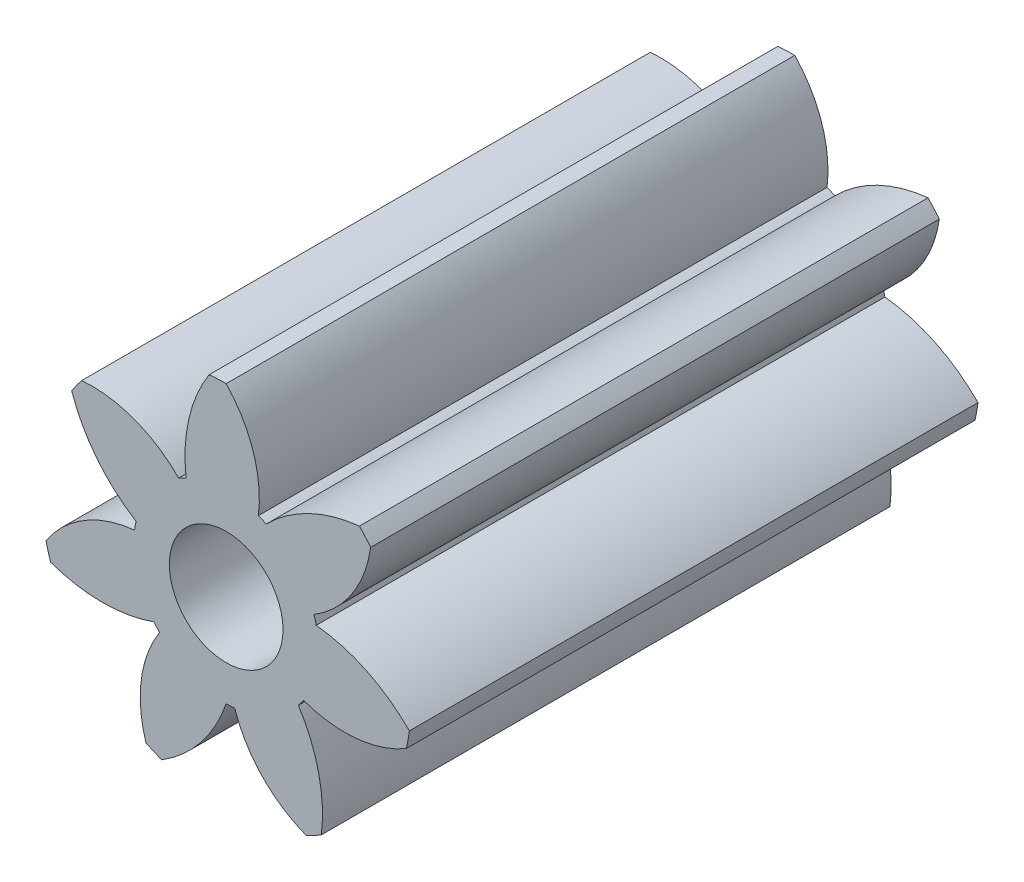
from build123d import *

# Parameters (mm, degrees)
ESQUISSE1_R                  = 1.3
ESQUISSE1_R_2                = 0.4
EXTRUSION1_DEPTH             = 4
EXTRUSION3_DEPTH             = 5.402272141
R_P_TITION_CIRCULAIRE2_COUNT = 7


with BuildPart() as part:
    # Esquisse1 → Extrusion1 (new body)
    with BuildSketch(Plane.XY):
        Circle(ESQUISSE1_R)
        Circle(ESQUISSE1_R_2, mode=Mode.SUBTRACT)
    extrude(amount=EXTRUSION1_DEPTH)

    # Esquisse3 → Extrusion3 (cut, through all)
    with BuildSketch(Plane.XY.offset(4)):
        with BuildLine():
            ThreePointArc((-0.119963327, 1.294453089), (-0.262543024, 0.954113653), (-0.28202443, 0.585629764))
            ThreePointArc((-0.28202443, 0.585629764), (-0.308773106, 0.571978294), (-0.334862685, 0.557105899))
            ThreePointArc((-0.334862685, 0.557105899), (-0.647184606, 0.760293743), (-1.016380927, 0.810536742))
            ThreePointArc((-1.016380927, 0.810536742), (-0.617546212, 1.143956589), (-0.119963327, 1.294453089))
        make_face()
    extrusion3 = extrude(amount=-EXTRUSION3_DEPTH, mode=Mode.SUBTRACT)

    # R_p_tition circulaire2: Extrusion3 ×7 about axis
    r_p_tition_circulaire2_axis = Axis((0, 0, 0), (0, 0, 1))
    for i in range(1, R_P_TITION_CIRCULAIRE2_COUNT):
        add(extrusion3.rotate(r_p_tition_circulaire2_axis, i * 360 / R_P_TITION_CIRCULAIRE2_COUNT), mode=Mode.SUBTRACT)


solid = part.part
